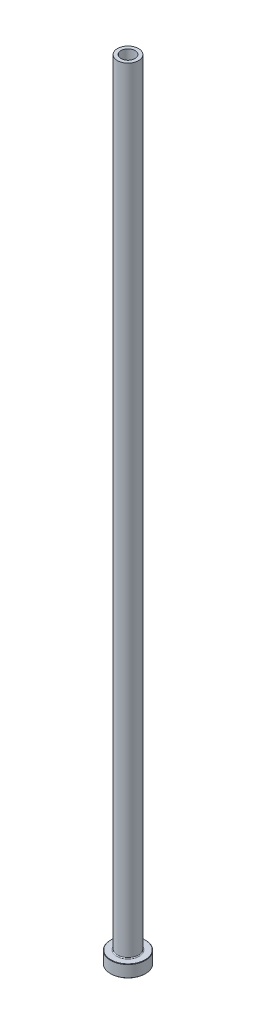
ISO-10303-21;
HEADER;
FILE_DESCRIPTION(('STEP AP214'),'2;1');
FILE_NAME('part.step','',(''),(''),'','','');
FILE_SCHEMA(('AUTOMOTIVE_DESIGN { 1 0 10303 214 1 1 1 1 }'));
ENDSEC;
DATA;
#1=APPLICATION_CONTEXT('core data for automotive mechanical design processes');
#2=APPLICATION_PROTOCOL_DEFINITION('international standard','automotive_design',2000,#1);
#3=PRODUCT_CONTEXT('',#1,'mechanical');
#4=PRODUCT('Part','Part','',(#3));
#5=PRODUCT_RELATED_PRODUCT_CATEGORY('part','',(#4));
#6=PRODUCT_DEFINITION_FORMATION('','',#4);
#7=PRODUCT_DEFINITION_CONTEXT('part definition',#1,'design');
#8=PRODUCT_DEFINITION('design','',#6,#7);
#9=PRODUCT_DEFINITION_SHAPE('','',#8);
#10=(LENGTH_UNIT() NAMED_UNIT(*) SI_UNIT(.MILLI.,.METRE.));
#11=(NAMED_UNIT(*) PLANE_ANGLE_UNIT() SI_UNIT($,.RADIAN.));
#12=(NAMED_UNIT(*) SI_UNIT($,.STERADIAN.) SOLID_ANGLE_UNIT());
#13=UNCERTAINTY_MEASURE_WITH_UNIT(LENGTH_MEASURE(1.E-05),#10,'distance_accuracy_value','');
#14=(GEOMETRIC_REPRESENTATION_CONTEXT(3) GLOBAL_UNCERTAINTY_ASSIGNED_CONTEXT((#13)) GLOBAL_UNIT_ASSIGNED_CONTEXT((#10,
#11,#12)) REPRESENTATION_CONTEXT('',''));
#15=CARTESIAN_POINT('',(0.,0.,0.));
#16=DIRECTION('',(0.,0.,1.));
#17=DIRECTION('',(1.,0.,0.));
#18=AXIS2_PLACEMENT_3D('',#15,#16,#17);
#19=CARTESIAN_POINT('',(0.,92.1876809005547,0.));
#20=DIRECTION('',(0.,1.,0.));
#21=DIRECTION('',(0.,0.,1.));
#22=AXIS2_PLACEMENT_3D('',#19,#20,#21);
#23=CYLINDRICAL_SURFACE('',#22,4.00000000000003);
#24=CARTESIAN_POINT('',(0.,450.,0.));
#25=DIRECTION('',(0.,1.,0.));
#26=DIRECTION('',(0.,0.,1.));
#27=AXIS2_PLACEMENT_3D('',#24,#25,#26);
#28=CIRCLE('',#27,4.00000000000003);
#29=CARTESIAN_POINT('',(0.,450.,4.00000000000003));
#30=VERTEX_POINT('',#29);
#31=EDGE_CURVE('E62',#30,#30,#28,.T.);
#32=ORIENTED_EDGE('',*,*,#31,.T.);
#33=EDGE_LOOP('',(#32));
#34=FACE_BOUND('',#33,.T.);
#35=CARTESIAN_POINT('',(0.,405.,0.));
#36=DIRECTION('',(0.,1.,0.));
#37=DIRECTION('',(0.,0.,1.));
#38=AXIS2_PLACEMENT_3D('',#35,#36,#37);
#39=CIRCLE('',#38,4.00000000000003);
#40=CARTESIAN_POINT('',(0.,405.,4.00000000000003));
#41=VERTEX_POINT('',#40);
#42=EDGE_CURVE('E71',#41,#41,#39,.T.);
#43=ORIENTED_EDGE('',*,*,#42,.F.);
#44=EDGE_LOOP('',(#43));
#45=FACE_BOUND('',#44,.T.);
#46=ADVANCED_FACE('F30',(#34,#45),#23,.F.);
#47=CARTESIAN_POINT('',(-4.00000000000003,450.,0.));
#48=DIRECTION('',(0.,1.,0.));
#49=DIRECTION('',(0.,0.,1.));
#50=AXIS2_PLACEMENT_3D('',#47,#48,#49);
#51=PLANE('',#50);
#52=CARTESIAN_POINT('',(0.,450.,0.));
#53=DIRECTION('',(0.,1.,0.));
#54=DIRECTION('',(0.,0.,1.));
#55=AXIS2_PLACEMENT_3D('',#52,#53,#54);
#56=CIRCLE('',#55,6.00000000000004);
#57=CARTESIAN_POINT('',(0.,450.,6.00000000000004));
#58=VERTEX_POINT('',#57);
#59=EDGE_CURVE('E65',#58,#58,#56,.T.);
#60=ORIENTED_EDGE('',*,*,#59,.T.);
#61=EDGE_LOOP('',(#60));
#62=FACE_BOUND('',#61,.T.);
#63=ORIENTED_EDGE('',*,*,#31,.F.);
#64=EDGE_LOOP('',(#63));
#65=FACE_BOUND('',#64,.T.);
#66=ADVANCED_FACE('F79',(#62,#65),#51,.T.);
#67=CARTESIAN_POINT('',(0.,92.1876809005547,0.));
#68=DIRECTION('',(0.,1.,0.));
#69=DIRECTION('',(0.,0.,1.));
#70=AXIS2_PLACEMENT_3D('',#67,#68,#69);
#71=CYLINDRICAL_SURFACE('',#70,6.00000000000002);
#72=CARTESIAN_POINT('',(0.,7.50000000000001,0.));
#73=DIRECTION('',(0.,1.,0.));
#74=DIRECTION('',(0.,0.,1.));
#75=AXIS2_PLACEMENT_3D('',#72,#73,#74);
#76=CIRCLE('',#75,6.00000000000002);
#77=CARTESIAN_POINT('',(0.,7.50000000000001,6.00000000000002));
#78=VERTEX_POINT('',#77);
#79=EDGE_CURVE('E59',#78,#78,#76,.T.);
#80=ORIENTED_EDGE('',*,*,#79,.T.);
#81=EDGE_LOOP('',(#80));
#82=FACE_BOUND('',#81,.T.);
#83=ORIENTED_EDGE('',*,*,#59,.F.);
#84=EDGE_LOOP('',(#83));
#85=FACE_BOUND('',#84,.T.);
#86=ADVANCED_FACE('F85',(#82,#85),#71,.T.);
#87=CARTESIAN_POINT('',(-5.99999999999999,7.,0.));
#88=DIRECTION('',(0.,1.,0.));
#89=DIRECTION('',(0.,0.,1.));
#90=AXIS2_PLACEMENT_3D('',#87,#88,#89);
#91=PLANE('',#90);
#92=CARTESIAN_POINT('',(0.,7.,0.));
#93=DIRECTION('',(0.,1.,0.));
#94=DIRECTION('',(0.,0.,1.));
#95=AXIS2_PLACEMENT_3D('',#92,#93,#94);
#96=CIRCLE('',#95,9.79999999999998);
#97=CARTESIAN_POINT('',(0.,7.,9.79999999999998));
#98=VERTEX_POINT('',#97);
#99=EDGE_CURVE('E53',#98,#98,#96,.T.);
#100=ORIENTED_EDGE('',*,*,#99,.T.);
#101=EDGE_LOOP('',(#100));
#102=FACE_BOUND('',#101,.T.);
#103=CARTESIAN_POINT('',(0.,7.,0.));
#104=DIRECTION('',(0.,1.,0.));
#105=DIRECTION('',(0.,0.,1.));
#106=AXIS2_PLACEMENT_3D('',#103,#104,#105);
#107=CIRCLE('',#106,6.50000000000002);
#108=CARTESIAN_POINT('',(0.,7.,6.50000000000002));
#109=VERTEX_POINT('',#108);
#110=EDGE_CURVE('E56',#109,#109,#107,.F.);
#111=ORIENTED_EDGE('',*,*,#110,.T.);
#112=EDGE_LOOP('',(#111));
#113=FACE_BOUND('',#112,.T.);
#114=ADVANCED_FACE('F111',(#102,#113),#91,.T.);
#115=CARTESIAN_POINT('',(0.,92.1876809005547,0.));
#116=DIRECTION('',(0.,1.,0.));
#117=DIRECTION('',(0.,0.,1.));
#118=AXIS2_PLACEMENT_3D('',#115,#116,#117);
#119=CYLINDRICAL_SURFACE('',#118,9.99999999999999);
#120=CARTESIAN_POINT('',(0.,6.79999999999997,0.));
#121=DIRECTION('',(0.,1.,0.));
#122=DIRECTION('',(0.,0.,1.));
#123=AXIS2_PLACEMENT_3D('',#120,#121,#122);
#124=CIRCLE('',#123,9.99999999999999);
#125=CARTESIAN_POINT('',(0.,6.79999999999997,9.99999999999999));
#126=VERTEX_POINT('',#125);
#127=EDGE_CURVE('E45',#126,#126,#124,.F.);
#128=ORIENTED_EDGE('',*,*,#127,.T.);
#129=EDGE_LOOP('',(#128));
#130=FACE_BOUND('',#129,.T.);
#131=CARTESIAN_POINT('',(0.,0.200000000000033,0.));
#132=DIRECTION('',(0.,-1.,0.));
#133=DIRECTION('',(0.,0.,-1.));
#134=AXIS2_PLACEMENT_3D('',#131,#132,#133);
#135=CIRCLE('',#134,9.99999999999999);
#136=CARTESIAN_POINT('',(0.,0.200000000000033,-9.99999999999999));
#137=VERTEX_POINT('',#136);
#138=EDGE_CURVE('E50',#137,#137,#135,.F.);
#139=ORIENTED_EDGE('',*,*,#138,.T.);
#140=EDGE_LOOP('',(#139));
#141=FACE_BOUND('',#140,.T.);
#142=ADVANCED_FACE('F108',(#130,#141),#119,.T.);
#143=CARTESIAN_POINT('',(-9.99999999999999,0.,0.));
#144=DIRECTION('',(0.,-1.,0.));
#145=DIRECTION('',(0.,0.,-1.));
#146=AXIS2_PLACEMENT_3D('',#143,#144,#145);
#147=PLANE('',#146);
#148=CARTESIAN_POINT('',(0.,0.,0.));
#149=DIRECTION('',(0.,-1.,0.));
#150=DIRECTION('',(0.,0.,-1.));
#151=AXIS2_PLACEMENT_3D('',#148,#149,#150);
#152=CIRCLE('',#151,4.74999999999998);
#153=CARTESIAN_POINT('',(0.,0.,-4.74999999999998));
#154=VERTEX_POINT('',#153);
#155=EDGE_CURVE('E37',#154,#154,#152,.F.);
#156=ORIENTED_EDGE('',*,*,#155,.T.);
#157=EDGE_LOOP('',(#156));
#158=FACE_BOUND('',#157,.T.);
#159=CARTESIAN_POINT('',(0.,0.,0.));
#160=DIRECTION('',(0.,-1.,0.));
#161=DIRECTION('',(0.,0.,-1.));
#162=AXIS2_PLACEMENT_3D('',#159,#160,#161);
#163=CIRCLE('',#162,9.79999999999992);
#164=CARTESIAN_POINT('',(0.,0.,-9.79999999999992));
#165=VERTEX_POINT('',#164);
#166=EDGE_CURVE('E41',#165,#165,#163,.T.);
#167=ORIENTED_EDGE('',*,*,#166,.T.);
#168=EDGE_LOOP('',(#167));
#169=FACE_BOUND('',#168,.T.);
#170=ADVANCED_FACE('F110',(#158,#169),#147,.T.);
#171=CARTESIAN_POINT('',(0.,92.1876809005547,0.));
#172=DIRECTION('',(0.,1.,0.));
#173=DIRECTION('',(0.,0.,1.));
#174=AXIS2_PLACEMENT_3D('',#171,#172,#173);
#175=CYLINDRICAL_SURFACE('',#174,4.25000000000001);
#176=CARTESIAN_POINT('',(0.,0.499999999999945,0.));
#177=DIRECTION('',(0.,-1.,0.));
#178=DIRECTION('',(0.,0.,-1.));
#179=AXIS2_PLACEMENT_3D('',#176,#177,#178);
#180=CIRCLE('',#179,4.25000000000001);
#181=CARTESIAN_POINT('',(0.,0.499999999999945,-4.25000000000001));
#182=VERTEX_POINT('',#181);
#183=EDGE_CURVE('E10',#182,#182,#180,.T.);
#184=ORIENTED_EDGE('',*,*,#183,.T.);
#185=EDGE_LOOP('',(#184));
#186=FACE_BOUND('',#185,.T.);
#187=CARTESIAN_POINT('',(0.,393.,0.));
#188=DIRECTION('',(0.,1.,0.));
#189=DIRECTION('',(0.,0.,1.));
#190=AXIS2_PLACEMENT_3D('',#187,#188,#189);
#191=CIRCLE('',#190,4.25000000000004);
#192=CARTESIAN_POINT('',(0.,393.,4.25000000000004));
#193=VERTEX_POINT('',#192);
#194=EDGE_CURVE('E68',#193,#193,#191,.T.);
#195=ORIENTED_EDGE('',*,*,#194,.T.);
#196=EDGE_LOOP('',(#195));
#197=FACE_BOUND('',#196,.T.);
#198=ADVANCED_FACE('F118',(#186,#197),#175,.F.);
#199=CARTESIAN_POINT('',(0.,393.,0.));
#200=DIRECTION('',(0.,-1.,0.));
#201=DIRECTION('',(0.,0.,-1.));
#202=AXIS2_PLACEMENT_3D('',#199,#200,#201);
#203=CONICAL_SURFACE('',#202,4.25000000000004,0.0208303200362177);
#204=ORIENTED_EDGE('',*,*,#42,.T.);
#205=EDGE_LOOP('',(#204));
#206=FACE_BOUND('',#205,.T.);
#207=ORIENTED_EDGE('',*,*,#194,.F.);
#208=EDGE_LOOP('',(#207));
#209=FACE_BOUND('',#208,.T.);
#210=ADVANCED_FACE('F75',(#206,#209),#203,.F.);
#211=CARTESIAN_POINT('',(0.,7.50000000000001,0.));
#212=DIRECTION('',(0.,1.,0.));
#213=DIRECTION('',(0.,0.,1.));
#214=AXIS2_PLACEMENT_3D('',#211,#212,#213);
#215=TOROIDAL_SURFACE('',#214,6.50000000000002,0.5);
#216=ORIENTED_EDGE('',*,*,#110,.F.);
#217=EDGE_LOOP('',(#216));
#218=FACE_BOUND('',#217,.T.);
#219=ORIENTED_EDGE('',*,*,#79,.F.);
#220=EDGE_LOOP('',(#219));
#221=FACE_BOUND('',#220,.T.);
#222=ADVANCED_FACE('F90',(#218,#221),#215,.F.);
#223=CARTESIAN_POINT('',(0.,7.00000000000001,0.));
#224=DIRECTION('',(0.,-1.,0.));
#225=DIRECTION('',(0.,0.,-1.));
#226=AXIS2_PLACEMENT_3D('',#223,#224,#225);
#227=CONICAL_SURFACE('',#226,9.79999999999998,0.785398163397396);
#228=ORIENTED_EDGE('',*,*,#127,.F.);
#229=EDGE_LOOP('',(#228));
#230=FACE_BOUND('',#229,.T.);
#231=ORIENTED_EDGE('',*,*,#99,.F.);
#232=EDGE_LOOP('',(#231));
#233=FACE_BOUND('',#232,.T.);
#234=ADVANCED_FACE('F93',(#230,#233),#227,.T.);
#235=CARTESIAN_POINT('',(0.,0.200000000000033,0.));
#236=DIRECTION('',(0.,1.,0.));
#237=DIRECTION('',(0.,0.,1.));
#238=AXIS2_PLACEMENT_3D('',#235,#236,#237);
#239=CONICAL_SURFACE('',#238,9.99999999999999,0.785398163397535);
#240=ORIENTED_EDGE('',*,*,#166,.F.);
#241=EDGE_LOOP('',(#240));
#242=FACE_BOUND('',#241,.T.);
#243=ORIENTED_EDGE('',*,*,#138,.F.);
#244=EDGE_LOOP('',(#243));
#245=FACE_BOUND('',#244,.T.);
#246=ADVANCED_FACE('F96',(#242,#245),#239,.T.);
#247=CARTESIAN_POINT('',(0.,0.,0.));
#248=DIRECTION('',(0.,-1.,0.));
#249=DIRECTION('',(0.,0.,-1.));
#250=AXIS2_PLACEMENT_3D('',#247,#248,#249);
#251=CONICAL_SURFACE('',#250,4.74999999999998,0.785398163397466);
#252=ORIENTED_EDGE('',*,*,#183,.F.);
#253=EDGE_LOOP('',(#252));
#254=FACE_BOUND('',#253,.T.);
#255=ORIENTED_EDGE('',*,*,#155,.F.);
#256=EDGE_LOOP('',(#255));
#257=FACE_BOUND('',#256,.T.);
#258=ADVANCED_FACE('F32',(#254,#257),#251,.F.);
#259=CLOSED_SHELL('',(#46,#66,#86,#114,#142,#170,#198,#210,#222,#234,#246,#258));
#260=MANIFOLD_SOLID_BREP('B2',#259);
#261=ADVANCED_BREP_SHAPE_REPRESENTATION('',(#18,#260),#14);
#262=SHAPE_DEFINITION_REPRESENTATION(#9,#261);
ENDSEC;
END-ISO-10303-21;
